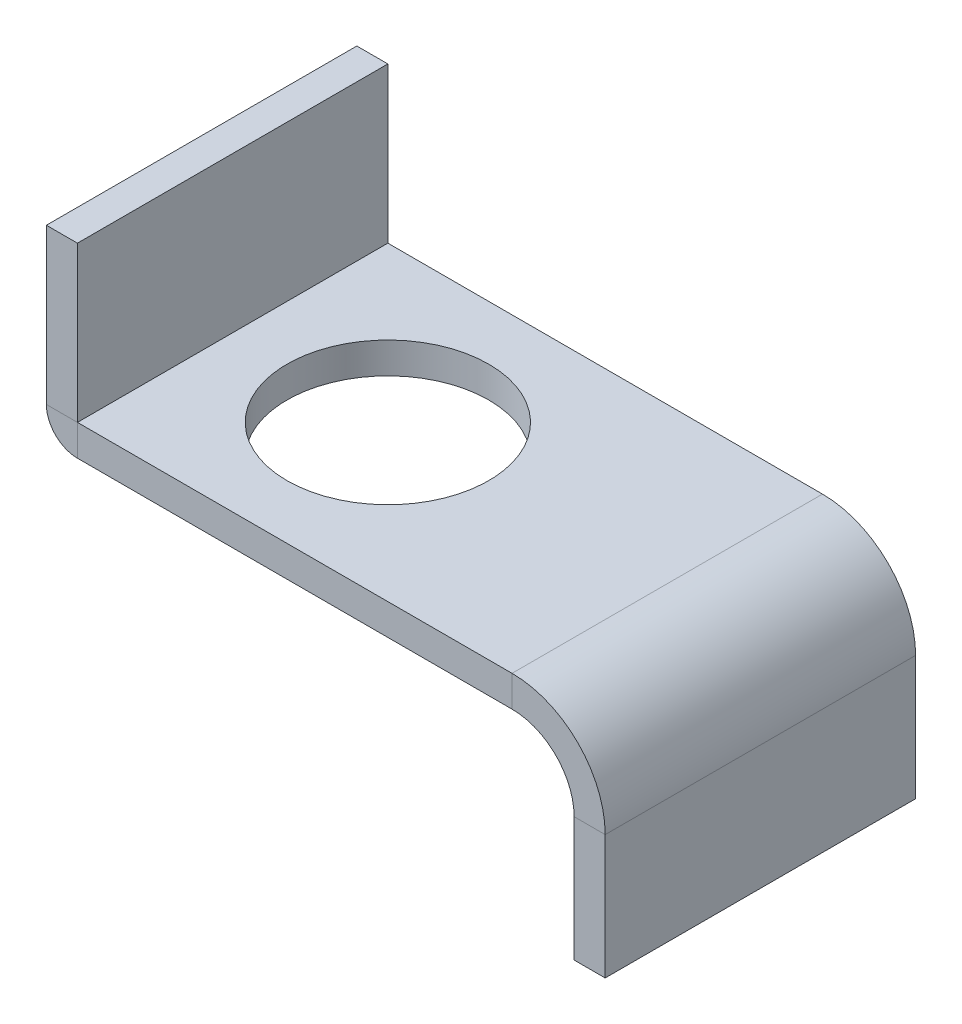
ISO-10303-21;
HEADER;
FILE_DESCRIPTION(('STEP AP214'),'2;1');
FILE_NAME('part.step','',(''),(''),'','','');
FILE_SCHEMA(('AUTOMOTIVE_DESIGN { 1 0 10303 214 1 1 1 1 }'));
ENDSEC;
DATA;
#1=APPLICATION_CONTEXT('core data for automotive mechanical design processes');
#2=APPLICATION_PROTOCOL_DEFINITION('international standard','automotive_design',2000,#1);
#3=PRODUCT_CONTEXT('',#1,'mechanical');
#4=PRODUCT('Part','Part','',(#3));
#5=PRODUCT_RELATED_PRODUCT_CATEGORY('part','',(#4));
#6=PRODUCT_DEFINITION_FORMATION('','',#4);
#7=PRODUCT_DEFINITION_CONTEXT('part definition',#1,'design');
#8=PRODUCT_DEFINITION('design','',#6,#7);
#9=PRODUCT_DEFINITION_SHAPE('','',#8);
#10=(LENGTH_UNIT() NAMED_UNIT(*) SI_UNIT(.MILLI.,.METRE.));
#11=(NAMED_UNIT(*) PLANE_ANGLE_UNIT() SI_UNIT($,.RADIAN.));
#12=(NAMED_UNIT(*) SI_UNIT($,.STERADIAN.) SOLID_ANGLE_UNIT());
#13=UNCERTAINTY_MEASURE_WITH_UNIT(LENGTH_MEASURE(1.E-05),#10,'distance_accuracy_value','');
#14=(GEOMETRIC_REPRESENTATION_CONTEXT(3) GLOBAL_UNCERTAINTY_ASSIGNED_CONTEXT((#13)) GLOBAL_UNIT_ASSIGNED_CONTEXT((#10,
#11,#12)) REPRESENTATION_CONTEXT('',''));
#15=CARTESIAN_POINT('',(0.,0.,0.));
#16=DIRECTION('',(0.,0.,1.));
#17=DIRECTION('',(1.,0.,0.));
#18=AXIS2_PLACEMENT_3D('',#15,#16,#17);
#19=CARTESIAN_POINT('',(17.,-3.,10.));
#20=DIRECTION('',(0.,0.,1.));
#21=DIRECTION('',(1.,0.,0.));
#22=AXIS2_PLACEMENT_3D('',#19,#20,#21);
#23=PLANE('',#22);
#24=DIRECTION('',(-1.,0.,0.));
#25=VECTOR('',#24,1.);
#26=CARTESIAN_POINT('',(17.,-3.,10.));
#27=LINE('',#26,#25);
#28=CARTESIAN_POINT('',(17.,-3.,10.));
#29=VERTEX_POINT('',#28);
#30=CARTESIAN_POINT('',(16.,-3.,10.));
#31=VERTEX_POINT('',#30);
#32=EDGE_CURVE('E11',#29,#31,#27,.T.);
#33=ORIENTED_EDGE('',*,*,#32,.F.);
#34=CARTESIAN_POINT('',(14.,-3.,10.));
#35=DIRECTION('',(0.,0.,-1.));
#36=DIRECTION('',(-1.,0.,0.));
#37=AXIS2_PLACEMENT_3D('',#34,#35,#36);
#38=CIRCLE('',#37,3.);
#39=CARTESIAN_POINT('',(14.,0.,10.));
#40=VERTEX_POINT('',#39);
#41=EDGE_CURVE('E179',#40,#29,#38,.T.);
#42=ORIENTED_EDGE('',*,*,#41,.F.);
#43=DIRECTION('',(0.,1.,0.));
#44=VECTOR('',#43,1.);
#45=CARTESIAN_POINT('',(14.,-1.,10.));
#46=LINE('',#45,#44);
#47=CARTESIAN_POINT('',(14.,-1.,10.));
#48=VERTEX_POINT('',#47);
#49=EDGE_CURVE('E47',#48,#40,#46,.T.);
#50=ORIENTED_EDGE('',*,*,#49,.F.);
#51=CARTESIAN_POINT('',(14.,-3.,10.));
#52=DIRECTION('',(0.,0.,1.));
#53=DIRECTION('',(1.,0.,0.));
#54=AXIS2_PLACEMENT_3D('',#51,#52,#53);
#55=CIRCLE('',#54,2.);
#56=EDGE_CURVE('E197',#48,#31,#55,.F.);
#57=ORIENTED_EDGE('',*,*,#56,.T.);
#58=EDGE_LOOP('',(#33,#42,#50,#57));
#59=FACE_BOUND('',#58,.T.);
#60=ADVANCED_FACE('F39',(#59),#23,.T.);
#61=CARTESIAN_POINT('',(14.,-1.,10.));
#62=DIRECTION('',(0.,0.,1.));
#63=DIRECTION('',(1.,0.,0.));
#64=AXIS2_PLACEMENT_3D('',#61,#62,#63);
#65=PLANE('',#64);
#66=DIRECTION('',(0.,-1.,0.));
#67=VECTOR('',#66,1.);
#68=CARTESIAN_POINT('',(17.,-3.,10.));
#69=LINE('',#68,#67);
#70=CARTESIAN_POINT('',(17.,-7.,10.));
#71=VERTEX_POINT('',#70);
#72=EDGE_CURVE('E176',#29,#71,#69,.T.);
#73=ORIENTED_EDGE('',*,*,#72,.F.);
#74=ORIENTED_EDGE('',*,*,#32,.T.);
#75=DIRECTION('',(0.,1.,0.));
#76=VECTOR('',#75,1.);
#77=CARTESIAN_POINT('',(16.,-3.,10.));
#78=LINE('',#77,#76);
#79=CARTESIAN_POINT('',(16.,-7.,10.));
#80=VERTEX_POINT('',#79);
#81=EDGE_CURVE('E173',#31,#80,#78,.F.);
#82=ORIENTED_EDGE('',*,*,#81,.T.);
#83=DIRECTION('',(-1.,0.,0.));
#84=VECTOR('',#83,1.);
#85=CARTESIAN_POINT('',(17.,-7.,10.));
#86=LINE('',#85,#84);
#87=EDGE_CURVE('E132',#71,#80,#86,.T.);
#88=ORIENTED_EDGE('',*,*,#87,.F.);
#89=EDGE_LOOP('',(#73,#74,#82,#88));
#90=FACE_BOUND('',#89,.T.);
#91=ADVANCED_FACE('F281',(#90),#65,.T.);
#92=CARTESIAN_POINT('',(14.,0.,0.));
#93=DIRECTION('',(0.,0.,-1.));
#94=DIRECTION('',(-1.,0.,0.));
#95=AXIS2_PLACEMENT_3D('',#92,#93,#94);
#96=PLANE('',#95);
#97=DIRECTION('',(0.,-1.,0.));
#98=VECTOR('',#97,1.);
#99=CARTESIAN_POINT('',(14.,0.,0.));
#100=LINE('',#99,#98);
#101=CARTESIAN_POINT('',(14.,0.,0.));
#102=VERTEX_POINT('',#101);
#103=CARTESIAN_POINT('',(14.,-1.,0.));
#104=VERTEX_POINT('',#103);
#105=EDGE_CURVE('E234',#102,#104,#100,.T.);
#106=ORIENTED_EDGE('',*,*,#105,.F.);
#107=CARTESIAN_POINT('',(14.,-3.,0.));
#108=DIRECTION('',(0.,0.,-1.));
#109=DIRECTION('',(-1.,0.,0.));
#110=AXIS2_PLACEMENT_3D('',#107,#108,#109);
#111=CIRCLE('',#110,3.);
#112=CARTESIAN_POINT('',(17.,-3.,0.));
#113=VERTEX_POINT('',#112);
#114=EDGE_CURVE('E150',#102,#113,#111,.T.);
#115=ORIENTED_EDGE('',*,*,#114,.T.);
#116=DIRECTION('',(1.,0.,0.));
#117=VECTOR('',#116,1.);
#118=CARTESIAN_POINT('',(16.,-3.,0.));
#119=LINE('',#118,#117);
#120=CARTESIAN_POINT('',(16.,-3.,0.));
#121=VERTEX_POINT('',#120);
#122=EDGE_CURVE('E232',#121,#113,#119,.T.);
#123=ORIENTED_EDGE('',*,*,#122,.F.);
#124=CARTESIAN_POINT('',(14.,-3.,0.));
#125=DIRECTION('',(0.,0.,1.));
#126=DIRECTION('',(1.,0.,0.));
#127=AXIS2_PLACEMENT_3D('',#124,#125,#126);
#128=CIRCLE('',#127,2.);
#129=EDGE_CURVE('E170',#104,#121,#128,.F.);
#130=ORIENTED_EDGE('',*,*,#129,.F.);
#131=EDGE_LOOP('',(#106,#115,#123,#130));
#132=FACE_BOUND('',#131,.T.);
#133=ADVANCED_FACE('F285',(#132),#96,.T.);
#134=CARTESIAN_POINT('',(16.,-3.,0.));
#135=DIRECTION('',(0.,0.,-1.));
#136=DIRECTION('',(-1.,0.,0.));
#137=AXIS2_PLACEMENT_3D('',#134,#135,#136);
#138=PLANE('',#137);
#139=DIRECTION('',(1.,0.,0.));
#140=VECTOR('',#139,1.);
#141=CARTESIAN_POINT('',(0.,0.,0.));
#142=LINE('',#141,#140);
#143=CARTESIAN_POINT('',(0.,0.,0.));
#144=VERTEX_POINT('',#143);
#145=EDGE_CURVE('E156',#144,#102,#142,.T.);
#146=ORIENTED_EDGE('',*,*,#145,.T.);
#147=ORIENTED_EDGE('',*,*,#105,.T.);
#148=DIRECTION('',(1.,0.,0.));
#149=VECTOR('',#148,1.);
#150=CARTESIAN_POINT('',(0.,-1.,0.));
#151=LINE('',#150,#149);
#152=CARTESIAN_POINT('',(0.,-1.,0.));
#153=VERTEX_POINT('',#152);
#154=EDGE_CURVE('E167',#153,#104,#151,.T.);
#155=ORIENTED_EDGE('',*,*,#154,.F.);
#156=DIRECTION('',(0.,-1.,0.));
#157=VECTOR('',#156,1.);
#158=CARTESIAN_POINT('',(0.,0.,0.));
#159=LINE('',#158,#157);
#160=EDGE_CURVE('E230',#144,#153,#159,.T.);
#161=ORIENTED_EDGE('',*,*,#160,.F.);
#162=EDGE_LOOP('',(#146,#147,#155,#161));
#163=FACE_BOUND('',#162,.T.);
#164=ADVANCED_FACE('F287',(#163),#138,.T.);
#165=CARTESIAN_POINT('',(0.,0.,0.));
#166=DIRECTION('',(0.,0.,-1.));
#167=DIRECTION('',(-1.,0.,0.));
#168=AXIS2_PLACEMENT_3D('',#165,#166,#167);
#169=PLANE('',#168);
#170=DIRECTION('',(0.,1.,0.));
#171=VECTOR('',#170,1.);
#172=CARTESIAN_POINT('',(16.,-3.,0.));
#173=LINE('',#172,#171);
#174=CARTESIAN_POINT('',(16.,-7.,0.));
#175=VERTEX_POINT('',#174);
#176=EDGE_CURVE('E140',#121,#175,#173,.F.);
#177=ORIENTED_EDGE('',*,*,#176,.F.);
#178=ORIENTED_EDGE('',*,*,#122,.T.);
#179=DIRECTION('',(0.,-1.,0.));
#180=VECTOR('',#179,1.);
#181=CARTESIAN_POINT('',(17.,-3.,0.));
#182=LINE('',#181,#180);
#183=CARTESIAN_POINT('',(17.,-7.,0.));
#184=VERTEX_POINT('',#183);
#185=EDGE_CURVE('E148',#113,#184,#182,.T.);
#186=ORIENTED_EDGE('',*,*,#185,.T.);
#187=DIRECTION('',(-1.,0.,0.));
#188=VECTOR('',#187,1.);
#189=CARTESIAN_POINT('',(17.,-7.,0.));
#190=LINE('',#189,#188);
#191=EDGE_CURVE('E129',#184,#175,#190,.T.);
#192=ORIENTED_EDGE('',*,*,#191,.T.);
#193=EDGE_LOOP('',(#177,#178,#186,#192));
#194=FACE_BOUND('',#193,.T.);
#195=ADVANCED_FACE('F146',(#194),#169,.T.);
#196=CARTESIAN_POINT('',(0.,0.,0.));
#197=DIRECTION('',(0.,0.,-1.));
#198=DIRECTION('',(-1.,0.,0.));
#199=AXIS2_PLACEMENT_3D('',#196,#197,#198);
#200=PLANE('',#199);
#201=DIRECTION('',(-1.,0.,0.));
#202=VECTOR('',#201,1.);
#203=CARTESIAN_POINT('',(0.,0.,0.));
#204=LINE('',#203,#202);
#205=CARTESIAN_POINT('',(-1.,0.,0.));
#206=VERTEX_POINT('',#205);
#207=EDGE_CURVE('E62',#144,#206,#204,.T.);
#208=ORIENTED_EDGE('',*,*,#207,.F.);
#209=ORIENTED_EDGE('',*,*,#160,.T.);
#210=CARTESIAN_POINT('',(0.,0.,0.));
#211=DIRECTION('',(0.,0.,-1.));
#212=DIRECTION('',(-1.,0.,0.));
#213=AXIS2_PLACEMENT_3D('',#210,#211,#212);
#214=CIRCLE('',#213,1.);
#215=EDGE_CURVE('E220',#153,#206,#214,.T.);
#216=ORIENTED_EDGE('',*,*,#215,.T.);
#217=EDGE_LOOP('',(#208,#209,#216));
#218=FACE_BOUND('',#217,.T.);
#219=ADVANCED_FACE('F289',(#218),#200,.T.);
#220=CARTESIAN_POINT('',(0.,0.,10.));
#221=DIRECTION('',(0.,0.,1.));
#222=DIRECTION('',(1.,0.,0.));
#223=AXIS2_PLACEMENT_3D('',#220,#221,#222);
#224=PLANE('',#223);
#225=DIRECTION('',(-1.,0.,0.));
#226=VECTOR('',#225,1.);
#227=CARTESIAN_POINT('',(0.,0.,10.));
#228=LINE('',#227,#226);
#229=CARTESIAN_POINT('',(0.,0.,10.));
#230=VERTEX_POINT('',#229);
#231=CARTESIAN_POINT('',(-1.,0.,10.));
#232=VERTEX_POINT('',#231);
#233=EDGE_CURVE('E54',#230,#232,#228,.T.);
#234=ORIENTED_EDGE('',*,*,#233,.F.);
#235=DIRECTION('',(0.,-1.,0.));
#236=VECTOR('',#235,1.);
#237=CARTESIAN_POINT('',(0.,5.,10.));
#238=LINE('',#237,#236);
#239=CARTESIAN_POINT('',(0.,5.,10.));
#240=VERTEX_POINT('',#239);
#241=EDGE_CURVE('E185',#240,#230,#238,.T.);
#242=ORIENTED_EDGE('',*,*,#241,.F.);
#243=DIRECTION('',(1.,0.,0.));
#244=VECTOR('',#243,1.);
#245=CARTESIAN_POINT('',(-0.999999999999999,5.,10.));
#246=LINE('',#245,#244);
#247=CARTESIAN_POINT('',(-0.999999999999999,5.,10.));
#248=VERTEX_POINT('',#247);
#249=EDGE_CURVE('E188',#248,#240,#246,.T.);
#250=ORIENTED_EDGE('',*,*,#249,.F.);
#251=DIRECTION('',(0.,-1.,0.));
#252=VECTOR('',#251,1.);
#253=CARTESIAN_POINT('',(-0.999999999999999,5.,10.));
#254=LINE('',#253,#252);
#255=EDGE_CURVE('E191',#248,#232,#254,.T.);
#256=ORIENTED_EDGE('',*,*,#255,.T.);
#257=EDGE_LOOP('',(#234,#242,#250,#256));
#258=FACE_BOUND('',#257,.T.);
#259=ADVANCED_FACE('F258',(#258),#224,.T.);
#260=CARTESIAN_POINT('',(0.,0.,10.));
#261=DIRECTION('',(0.,0.,1.));
#262=DIRECTION('',(1.,0.,0.));
#263=AXIS2_PLACEMENT_3D('',#260,#261,#262);
#264=PLANE('',#263);
#265=DIRECTION('',(0.,-1.,0.));
#266=VECTOR('',#265,1.);
#267=CARTESIAN_POINT('',(0.,0.,10.));
#268=LINE('',#267,#266);
#269=CARTESIAN_POINT('',(0.,-1.,10.));
#270=VERTEX_POINT('',#269);
#271=EDGE_CURVE('E226',#230,#270,#268,.T.);
#272=ORIENTED_EDGE('',*,*,#271,.F.);
#273=ORIENTED_EDGE('',*,*,#233,.T.);
#274=CARTESIAN_POINT('',(0.,0.,10.));
#275=DIRECTION('',(0.,0.,-1.));
#276=DIRECTION('',(-1.,0.,0.));
#277=AXIS2_PLACEMENT_3D('',#274,#275,#276);
#278=CIRCLE('',#277,1.);
#279=EDGE_CURVE('E224',#232,#270,#278,.F.);
#280=ORIENTED_EDGE('',*,*,#279,.T.);
#281=EDGE_LOOP('',(#272,#273,#280));
#282=FACE_BOUND('',#281,.T.);
#283=ADVANCED_FACE('F271',(#282),#264,.T.);
#284=CARTESIAN_POINT('',(16.,-3.,10.));
#285=DIRECTION('',(1.,0.,0.));
#286=DIRECTION('',(0.,0.,-1.));
#287=AXIS2_PLACEMENT_3D('',#284,#285,#286);
#288=PLANE('',#287);
#289=ORIENTED_EDGE('',*,*,#176,.T.);
#290=DIRECTION('',(0.,0.,-1.));
#291=VECTOR('',#290,1.);
#292=CARTESIAN_POINT('',(16.,-7.,10.));
#293=LINE('',#292,#291);
#294=EDGE_CURVE('E125',#80,#175,#293,.T.);
#295=ORIENTED_EDGE('',*,*,#294,.F.);
#296=ORIENTED_EDGE('',*,*,#81,.F.);
#297=DIRECTION('',(0.,0.,-1.));
#298=VECTOR('',#297,1.);
#299=CARTESIAN_POINT('',(16.,-3.,10.));
#300=LINE('',#299,#298);
#301=EDGE_CURVE('E143',#31,#121,#300,.T.);
#302=ORIENTED_EDGE('',*,*,#301,.T.);
#303=EDGE_LOOP('',(#289,#295,#296,#302));
#304=FACE_BOUND('',#303,.T.);
#305=ADVANCED_FACE('F141',(#304),#288,.F.);
#306=CARTESIAN_POINT('',(17.,-7.,10.));
#307=DIRECTION('',(0.,-1.,0.));
#308=DIRECTION('',(1.,0.,0.));
#309=AXIS2_PLACEMENT_3D('',#306,#307,#308);
#310=PLANE('',#309);
#311=ORIENTED_EDGE('',*,*,#191,.F.);
#312=DIRECTION('',(0.,0.,-1.));
#313=VECTOR('',#312,1.);
#314=CARTESIAN_POINT('',(17.,-7.,10.));
#315=LINE('',#314,#313);
#316=EDGE_CURVE('E136',#71,#184,#315,.T.);
#317=ORIENTED_EDGE('',*,*,#316,.F.);
#318=ORIENTED_EDGE('',*,*,#87,.T.);
#319=ORIENTED_EDGE('',*,*,#294,.T.);
#320=EDGE_LOOP('',(#311,#317,#318,#319));
#321=FACE_BOUND('',#320,.T.);
#322=ADVANCED_FACE('F127',(#321),#310,.T.);
#323=CARTESIAN_POINT('',(17.,-3.,10.));
#324=DIRECTION('',(1.,0.,0.));
#325=DIRECTION('',(0.,0.,-1.));
#326=AXIS2_PLACEMENT_3D('',#323,#324,#325);
#327=PLANE('',#326);
#328=ORIENTED_EDGE('',*,*,#185,.F.);
#329=DIRECTION('',(0.,0.,-1.));
#330=VECTOR('',#329,1.);
#331=CARTESIAN_POINT('',(17.,-3.,10.));
#332=LINE('',#331,#330);
#333=EDGE_CURVE('E214',#29,#113,#332,.T.);
#334=ORIENTED_EDGE('',*,*,#333,.F.);
#335=ORIENTED_EDGE('',*,*,#72,.T.);
#336=ORIENTED_EDGE('',*,*,#316,.T.);
#337=EDGE_LOOP('',(#328,#334,#335,#336));
#338=FACE_BOUND('',#337,.T.);
#339=ADVANCED_FACE('F283',(#338),#327,.T.);
#340=CARTESIAN_POINT('',(14.,-3.,10.));
#341=DIRECTION('',(0.,0.,-1.));
#342=DIRECTION('',(-1.,0.,0.));
#343=AXIS2_PLACEMENT_3D('',#340,#341,#342);
#344=CYLINDRICAL_SURFACE('',#343,3.);
#345=ORIENTED_EDGE('',*,*,#114,.F.);
#346=DIRECTION('',(0.,0.,-1.));
#347=VECTOR('',#346,1.);
#348=CARTESIAN_POINT('',(14.,0.,10.));
#349=LINE('',#348,#347);
#350=EDGE_CURVE('E211',#40,#102,#349,.T.);
#351=ORIENTED_EDGE('',*,*,#350,.F.);
#352=ORIENTED_EDGE('',*,*,#41,.T.);
#353=ORIENTED_EDGE('',*,*,#333,.T.);
#354=EDGE_LOOP('',(#345,#351,#352,#353));
#355=FACE_BOUND('',#354,.T.);
#356=ADVANCED_FACE('F246',(#355),#344,.T.);
#357=CARTESIAN_POINT('',(0.,0.,10.));
#358=DIRECTION('',(0.,1.,0.));
#359=DIRECTION('',(0.,0.,1.));
#360=AXIS2_PLACEMENT_3D('',#357,#358,#359);
#361=PLANE('',#360);
#362=CARTESIAN_POINT('',(5.,0.,5.));
#363=DIRECTION('',(0.,1.,0.));
#364=DIRECTION('',(0.,0.,1.));
#365=AXIS2_PLACEMENT_3D('',#362,#363,#364);
#366=CIRCLE('',#365,3.25);
#367=CARTESIAN_POINT('',(5.,0.,8.25));
#368=VERTEX_POINT('',#367);
#369=EDGE_CURVE('E518',#368,#368,#366,.T.);
#370=ORIENTED_EDGE('',*,*,#369,.F.);
#371=EDGE_LOOP('',(#370));
#372=FACE_BOUND('',#371,.T.);
#373=ORIENTED_EDGE('',*,*,#145,.F.);
#374=DIRECTION('',(0.,0.,-1.));
#375=VECTOR('',#374,1.);
#376=CARTESIAN_POINT('',(0.,0.,10.));
#377=LINE('',#376,#375);
#378=EDGE_CURVE('E208',#230,#144,#377,.T.);
#379=ORIENTED_EDGE('',*,*,#378,.F.);
#380=DIRECTION('',(1.,0.,0.));
#381=VECTOR('',#380,1.);
#382=CARTESIAN_POINT('',(0.,0.,10.));
#383=LINE('',#382,#381);
#384=EDGE_CURVE('E182',#230,#40,#383,.T.);
#385=ORIENTED_EDGE('',*,*,#384,.T.);
#386=ORIENTED_EDGE('',*,*,#350,.T.);
#387=EDGE_LOOP('',(#373,#379,#385,#386));
#388=FACE_BOUND('',#387,.T.);
#389=ADVANCED_FACE('F251',(#372,#388),#361,.T.);
#390=CARTESIAN_POINT('',(0.,5.,10.));
#391=DIRECTION('',(1.,0.,0.));
#392=DIRECTION('',(0.,1.,0.));
#393=AXIS2_PLACEMENT_3D('',#390,#391,#392);
#394=PLANE('',#393);
#395=DIRECTION('',(0.,-1.,0.));
#396=VECTOR('',#395,1.);
#397=CARTESIAN_POINT('',(0.,5.,0.));
#398=LINE('',#397,#396);
#399=CARTESIAN_POINT('',(0.,5.,0.));
#400=VERTEX_POINT('',#399);
#401=EDGE_CURVE('E159',#400,#144,#398,.T.);
#402=ORIENTED_EDGE('',*,*,#401,.F.);
#403=DIRECTION('',(0.,0.,-1.));
#404=VECTOR('',#403,1.);
#405=CARTESIAN_POINT('',(0.,5.,10.));
#406=LINE('',#405,#404);
#407=EDGE_CURVE('E206',#240,#400,#406,.T.);
#408=ORIENTED_EDGE('',*,*,#407,.F.);
#409=ORIENTED_EDGE('',*,*,#241,.T.);
#410=ORIENTED_EDGE('',*,*,#378,.T.);
#411=EDGE_LOOP('',(#402,#408,#409,#410));
#412=FACE_BOUND('',#411,.T.);
#413=ADVANCED_FACE('F254',(#412),#394,.T.);
#414=CARTESIAN_POINT('',(-0.999999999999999,5.,10.));
#415=DIRECTION('',(0.,1.,0.));
#416=DIRECTION('',(0.,0.,1.));
#417=AXIS2_PLACEMENT_3D('',#414,#415,#416);
#418=PLANE('',#417);
#419=DIRECTION('',(1.,0.,0.));
#420=VECTOR('',#419,1.);
#421=CARTESIAN_POINT('',(-0.999999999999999,5.,0.));
#422=LINE('',#421,#420);
#423=CARTESIAN_POINT('',(-0.999999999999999,5.,0.));
#424=VERTEX_POINT('',#423);
#425=EDGE_CURVE('E161',#424,#400,#422,.T.);
#426=ORIENTED_EDGE('',*,*,#425,.F.);
#427=DIRECTION('',(0.,0.,-1.));
#428=VECTOR('',#427,1.);
#429=CARTESIAN_POINT('',(-0.999999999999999,5.,10.));
#430=LINE('',#429,#428);
#431=EDGE_CURVE('E204',#248,#424,#430,.T.);
#432=ORIENTED_EDGE('',*,*,#431,.F.);
#433=ORIENTED_EDGE('',*,*,#249,.T.);
#434=ORIENTED_EDGE('',*,*,#407,.T.);
#435=EDGE_LOOP('',(#426,#432,#433,#434));
#436=FACE_BOUND('',#435,.T.);
#437=ADVANCED_FACE('F261',(#436),#418,.T.);
#438=CARTESIAN_POINT('',(-0.999999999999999,5.,10.));
#439=DIRECTION('',(1.,0.,0.));
#440=DIRECTION('',(0.,1.,0.));
#441=AXIS2_PLACEMENT_3D('',#438,#439,#440);
#442=PLANE('',#441);
#443=DIRECTION('',(0.,-1.,0.));
#444=VECTOR('',#443,1.);
#445=CARTESIAN_POINT('',(-0.999999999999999,5.,0.));
#446=LINE('',#445,#444);
#447=EDGE_CURVE('E164',#424,#206,#446,.T.);
#448=ORIENTED_EDGE('',*,*,#447,.T.);
#449=DIRECTION('',(0.,0.,-1.));
#450=VECTOR('',#449,1.);
#451=CARTESIAN_POINT('',(-1.,0.,10.));
#452=LINE('',#451,#450);
#453=EDGE_CURVE('E222',#206,#232,#452,.F.);
#454=ORIENTED_EDGE('',*,*,#453,.T.);
#455=ORIENTED_EDGE('',*,*,#255,.F.);
#456=ORIENTED_EDGE('',*,*,#431,.T.);
#457=EDGE_LOOP('',(#448,#454,#455,#456));
#458=FACE_BOUND('',#457,.T.);
#459=ADVANCED_FACE('F264',(#458),#442,.F.);
#460=CARTESIAN_POINT('',(0.,-1.,10.));
#461=DIRECTION('',(0.,1.,0.));
#462=DIRECTION('',(0.,0.,1.));
#463=AXIS2_PLACEMENT_3D('',#460,#461,#462);
#464=PLANE('',#463);
#465=CARTESIAN_POINT('',(5.,-0.999999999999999,5.));
#466=DIRECTION('',(0.,1.,0.));
#467=DIRECTION('',(0.,0.,1.));
#468=AXIS2_PLACEMENT_3D('',#465,#466,#467);
#469=CIRCLE('',#468,3.25);
#470=CARTESIAN_POINT('',(5.,-0.999999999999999,8.25));
#471=VERTEX_POINT('',#470);
#472=EDGE_CURVE('E42',#471,#471,#469,.T.);
#473=ORIENTED_EDGE('',*,*,#472,.T.);
#474=EDGE_LOOP('',(#473));
#475=FACE_BOUND('',#474,.T.);
#476=DIRECTION('',(1.,0.,0.));
#477=VECTOR('',#476,1.);
#478=CARTESIAN_POINT('',(0.,-1.,10.));
#479=LINE('',#478,#477);
#480=EDGE_CURVE('E194',#270,#48,#479,.T.);
#481=ORIENTED_EDGE('',*,*,#480,.F.);
#482=DIRECTION('',(0.,0.,-1.));
#483=VECTOR('',#482,1.);
#484=CARTESIAN_POINT('',(0.,-1.,10.));
#485=LINE('',#484,#483);
#486=EDGE_CURVE('E135',#270,#153,#485,.T.);
#487=ORIENTED_EDGE('',*,*,#486,.T.);
#488=ORIENTED_EDGE('',*,*,#154,.T.);
#489=DIRECTION('',(0.,0.,-1.));
#490=VECTOR('',#489,1.);
#491=CARTESIAN_POINT('',(14.,-1.,10.));
#492=LINE('',#491,#490);
#493=EDGE_CURVE('E201',#48,#104,#492,.T.);
#494=ORIENTED_EDGE('',*,*,#493,.F.);
#495=EDGE_LOOP('',(#481,#487,#488,#494));
#496=FACE_BOUND('',#495,.T.);
#497=ADVANCED_FACE('F273',(#475,#496),#464,.F.);
#498=CARTESIAN_POINT('',(14.,-3.,10.));
#499=DIRECTION('',(0.,0.,-1.));
#500=DIRECTION('',(-1.,0.,0.));
#501=AXIS2_PLACEMENT_3D('',#498,#499,#500);
#502=CYLINDRICAL_SURFACE('',#501,2.);
#503=ORIENTED_EDGE('',*,*,#129,.T.);
#504=ORIENTED_EDGE('',*,*,#301,.F.);
#505=ORIENTED_EDGE('',*,*,#56,.F.);
#506=ORIENTED_EDGE('',*,*,#493,.T.);
#507=EDGE_LOOP('',(#503,#504,#505,#506));
#508=FACE_BOUND('',#507,.T.);
#509=ADVANCED_FACE('F278',(#508),#502,.F.);
#510=CARTESIAN_POINT('',(14.,-3.,10.));
#511=DIRECTION('',(0.,0.,-1.));
#512=DIRECTION('',(-1.,0.,0.));
#513=AXIS2_PLACEMENT_3D('',#510,#511,#512);
#514=PLANE('',#513);
#515=ORIENTED_EDGE('',*,*,#384,.F.);
#516=ORIENTED_EDGE('',*,*,#271,.T.);
#517=ORIENTED_EDGE('',*,*,#480,.T.);
#518=ORIENTED_EDGE('',*,*,#49,.T.);
#519=EDGE_LOOP('',(#515,#516,#517,#518));
#520=FACE_BOUND('',#519,.T.);
#521=ADVANCED_FACE('F239',(#520),#514,.F.);
#522=CARTESIAN_POINT('',(14.,-3.,0.));
#523=DIRECTION('',(0.,0.,-1.));
#524=DIRECTION('',(-1.,0.,0.));
#525=AXIS2_PLACEMENT_3D('',#522,#523,#524);
#526=PLANE('',#525);
#527=ORIENTED_EDGE('',*,*,#401,.T.);
#528=ORIENTED_EDGE('',*,*,#207,.T.);
#529=ORIENTED_EDGE('',*,*,#447,.F.);
#530=ORIENTED_EDGE('',*,*,#425,.T.);
#531=EDGE_LOOP('',(#527,#528,#529,#530));
#532=FACE_BOUND('',#531,.T.);
#533=ADVANCED_FACE('F290',(#532),#526,.T.);
#534=CARTESIAN_POINT('',(0.,0.,10.));
#535=DIRECTION('',(0.,0.,-1.));
#536=DIRECTION('',(-1.,0.,0.));
#537=AXIS2_PLACEMENT_3D('',#534,#535,#536);
#538=CYLINDRICAL_SURFACE('',#537,1.);
#539=ORIENTED_EDGE('',*,*,#279,.F.);
#540=ORIENTED_EDGE('',*,*,#453,.F.);
#541=ORIENTED_EDGE('',*,*,#215,.F.);
#542=ORIENTED_EDGE('',*,*,#486,.F.);
#543=EDGE_LOOP('',(#539,#540,#541,#542));
#544=FACE_BOUND('',#543,.T.);
#545=ADVANCED_FACE('F269',(#544),#538,.T.);
#546=CARTESIAN_POINT('',(5.,-10.,5.));
#547=DIRECTION('',(0.,1.,0.));
#548=DIRECTION('',(0.,0.,1.));
#549=AXIS2_PLACEMENT_3D('',#546,#547,#548);
#550=CYLINDRICAL_SURFACE('',#549,3.25);
#551=ORIENTED_EDGE('',*,*,#369,.T.);
#552=EDGE_LOOP('',(#551));
#553=FACE_BOUND('',#552,.T.);
#554=ORIENTED_EDGE('',*,*,#472,.F.);
#555=EDGE_LOOP('',(#554));
#556=FACE_BOUND('',#555,.T.);
#557=ADVANCED_FACE('F297',(#553,#556),#550,.F.);
#558=CLOSED_SHELL('',(#60,#91,#133,#164,#195,#219,#259,#283,#305,#322,#339,#356,#389,#413,#437,
#459,#497,#509,#521,#533,#545,#557));
#559=MANIFOLD_SOLID_BREP('B2',#558);
#560=ADVANCED_BREP_SHAPE_REPRESENTATION('',(#18,#559),#14);
#561=SHAPE_DEFINITION_REPRESENTATION(#9,#560);
ENDSEC;
END-ISO-10303-21;
